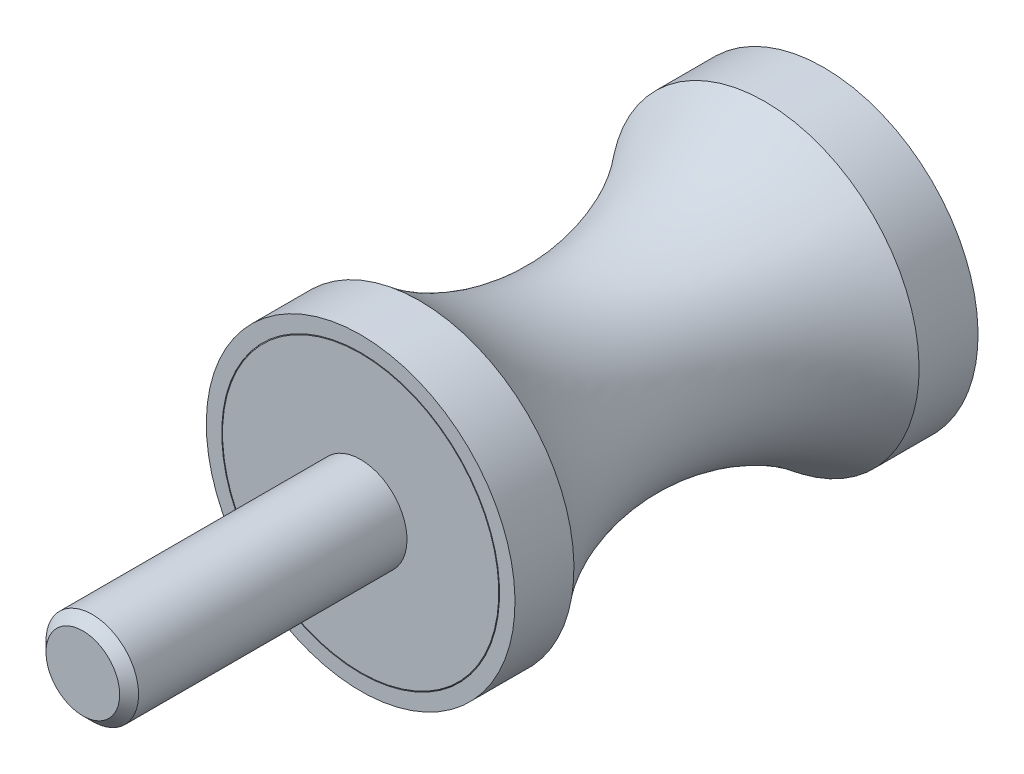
ISO-10303-21;
HEADER;
FILE_DESCRIPTION(('STEP AP214'),'2;1');
FILE_NAME('part.step','',(''),(''),'','','');
FILE_SCHEMA(('AUTOMOTIVE_DESIGN { 1 0 10303 214 1 1 1 1 }'));
ENDSEC;
DATA;
#1=APPLICATION_CONTEXT('core data for automotive mechanical design processes');
#2=APPLICATION_PROTOCOL_DEFINITION('international standard','automotive_design',2000,#1);
#3=PRODUCT_CONTEXT('',#1,'mechanical');
#4=PRODUCT('Part','Part','',(#3));
#5=PRODUCT_RELATED_PRODUCT_CATEGORY('part','',(#4));
#6=PRODUCT_DEFINITION_FORMATION('','',#4);
#7=PRODUCT_DEFINITION_CONTEXT('part definition',#1,'design');
#8=PRODUCT_DEFINITION('design','',#6,#7);
#9=PRODUCT_DEFINITION_SHAPE('','',#8);
#10=(LENGTH_UNIT() NAMED_UNIT(*) SI_UNIT(.MILLI.,.METRE.));
#11=(NAMED_UNIT(*) PLANE_ANGLE_UNIT() SI_UNIT($,.RADIAN.));
#12=(NAMED_UNIT(*) SI_UNIT($,.STERADIAN.) SOLID_ANGLE_UNIT());
#13=UNCERTAINTY_MEASURE_WITH_UNIT(LENGTH_MEASURE(1.E-05),#10,'distance_accuracy_value','');
#14=(GEOMETRIC_REPRESENTATION_CONTEXT(3) GLOBAL_UNCERTAINTY_ASSIGNED_CONTEXT((#13)) GLOBAL_UNIT_ASSIGNED_CONTEXT((#10,
#11,#12)) REPRESENTATION_CONTEXT('',''));
#15=CARTESIAN_POINT('',(0.,0.,0.));
#16=DIRECTION('',(0.,0.,1.));
#17=DIRECTION('',(1.,0.,0.));
#18=AXIS2_PLACEMENT_3D('',#15,#16,#17);
#19=CARTESIAN_POINT('',(0.,0.,0.5));
#20=DIRECTION('',(0.,0.,-1.));
#21=DIRECTION('',(0.,1.,0.));
#22=AXIS2_PLACEMENT_3D('',#19,#20,#21);
#23=CYLINDRICAL_SURFACE('',#22,9.);
#24=CARTESIAN_POINT('',(0.,0.,0.05));
#25=DIRECTION('',(0.,0.,-1.));
#26=DIRECTION('',(0.,1.,0.));
#27=AXIS2_PLACEMENT_3D('',#24,#25,#26);
#28=CIRCLE('',#27,9.);
#29=CARTESIAN_POINT('',(0.,9.,0.05));
#30=VERTEX_POINT('',#29);
#31=EDGE_CURVE('E53',#30,#30,#28,.T.);
#32=ORIENTED_EDGE('',*,*,#31,.F.);
#33=EDGE_LOOP('',(#32));
#34=FACE_BOUND('',#33,.T.);
#35=CARTESIAN_POINT('',(0.,0.,0.));
#36=DIRECTION('',(0.,0.,-1.));
#37=DIRECTION('',(0.,1.,0.));
#38=AXIS2_PLACEMENT_3D('',#35,#36,#37);
#39=CIRCLE('',#38,9.);
#40=CARTESIAN_POINT('',(0.,9.,0.));
#41=VERTEX_POINT('',#40);
#42=EDGE_CURVE('E44',#41,#41,#39,.T.);
#43=ORIENTED_EDGE('',*,*,#42,.T.);
#44=EDGE_LOOP('',(#43));
#45=FACE_BOUND('',#44,.T.);
#46=ADVANCED_FACE('F12',(#34,#45),#23,.F.);
#47=CARTESIAN_POINT('',(0.,0.,0.5));
#48=DIRECTION('',(0.,0.,-1.));
#49=DIRECTION('',(0.,1.,0.));
#50=AXIS2_PLACEMENT_3D('',#47,#48,#49);
#51=CYLINDRICAL_SURFACE('',#50,9.);
#52=CARTESIAN_POINT('',(0.,0.,30.));
#53=DIRECTION('',(0.,0.,-1.));
#54=DIRECTION('',(0.,1.,0.));
#55=AXIS2_PLACEMENT_3D('',#52,#53,#54);
#56=CIRCLE('',#55,9.);
#57=CARTESIAN_POINT('',(0.,9.,30.));
#58=VERTEX_POINT('',#57);
#59=EDGE_CURVE('E27',#58,#58,#56,.T.);
#60=ORIENTED_EDGE('',*,*,#59,.F.);
#61=EDGE_LOOP('',(#60));
#62=FACE_BOUND('',#61,.T.);
#63=CARTESIAN_POINT('',(0.,0.,29.95));
#64=DIRECTION('',(0.,0.,-1.));
#65=DIRECTION('',(0.,1.,0.));
#66=AXIS2_PLACEMENT_3D('',#63,#64,#65);
#67=CIRCLE('',#66,9.);
#68=CARTESIAN_POINT('',(0.,9.,29.95));
#69=VERTEX_POINT('',#68);
#70=EDGE_CURVE('E50',#69,#69,#67,.T.);
#71=ORIENTED_EDGE('',*,*,#70,.T.);
#72=EDGE_LOOP('',(#71));
#73=FACE_BOUND('',#72,.T.);
#74=ADVANCED_FACE('F89',(#62,#73),#51,.F.);
#75=CARTESIAN_POINT('',(9.,0.,30.));
#76=DIRECTION('',(0.,0.,-1.));
#77=DIRECTION('',(0.,1.,0.));
#78=AXIS2_PLACEMENT_3D('',#75,#76,#77);
#79=PLANE('',#78);
#80=CARTESIAN_POINT('',(0.,0.,30.));
#81=DIRECTION('',(0.,0.,-1.));
#82=DIRECTION('',(0.,1.,0.));
#83=AXIS2_PLACEMENT_3D('',#80,#81,#82);
#84=CIRCLE('',#83,10.);
#85=CARTESIAN_POINT('',(0.,10.,30.));
#86=VERTEX_POINT('',#85);
#87=EDGE_CURVE('E32',#86,#86,#84,.T.);
#88=ORIENTED_EDGE('',*,*,#87,.F.);
#89=EDGE_LOOP('',(#88));
#90=FACE_BOUND('',#89,.T.);
#91=ORIENTED_EDGE('',*,*,#59,.T.);
#92=EDGE_LOOP('',(#91));
#93=FACE_BOUND('',#92,.T.);
#94=ADVANCED_FACE('F115',(#90,#93),#79,.F.);
#95=CARTESIAN_POINT('',(0.,0.,0.5));
#96=DIRECTION('',(0.,0.,-1.));
#97=DIRECTION('',(0.,1.,0.));
#98=AXIS2_PLACEMENT_3D('',#95,#96,#97);
#99=CYLINDRICAL_SURFACE('',#98,10.);
#100=CARTESIAN_POINT('',(0.,0.,26.1803398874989));
#101=DIRECTION('',(0.,0.,-1.));
#102=DIRECTION('',(0.,1.,0.));
#103=AXIS2_PLACEMENT_3D('',#100,#101,#102);
#104=CIRCLE('',#103,10.);
#105=CARTESIAN_POINT('',(0.,10.,26.1803398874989));
#106=VERTEX_POINT('',#105);
#107=EDGE_CURVE('E35',#106,#106,#104,.T.);
#108=ORIENTED_EDGE('',*,*,#107,.F.);
#109=EDGE_LOOP('',(#108));
#110=FACE_BOUND('',#109,.T.);
#111=ORIENTED_EDGE('',*,*,#87,.T.);
#112=EDGE_LOOP('',(#111));
#113=FACE_BOUND('',#112,.T.);
#114=ADVANCED_FACE('F109',(#110,#113),#99,.T.);
#115=CARTESIAN_POINT('',(0.,0.,15.));
#116=DIRECTION('',(0.,0.,-1.));
#117=DIRECTION('',(0.,1.,0.));
#118=AXIS2_PLACEMENT_3D('',#115,#116,#117);
#119=TOROIDAL_SURFACE('',#118,23.625,17.625);
#120=CARTESIAN_POINT('',(0.,0.,3.81966011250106));
#121=DIRECTION('',(0.,0.,-1.));
#122=DIRECTION('',(0.,1.,0.));
#123=AXIS2_PLACEMENT_3D('',#120,#121,#122);
#124=CIRCLE('',#123,10.);
#125=CARTESIAN_POINT('',(0.,10.,3.81966011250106));
#126=VERTEX_POINT('',#125);
#127=EDGE_CURVE('E38',#126,#126,#124,.T.);
#128=ORIENTED_EDGE('',*,*,#127,.F.);
#129=EDGE_LOOP('',(#128));
#130=FACE_BOUND('',#129,.T.);
#131=ORIENTED_EDGE('',*,*,#107,.T.);
#132=EDGE_LOOP('',(#131));
#133=FACE_BOUND('',#132,.T.);
#134=ADVANCED_FACE('F103',(#130,#133),#119,.F.);
#135=CARTESIAN_POINT('',(0.,0.,0.5));
#136=DIRECTION('',(0.,0.,-1.));
#137=DIRECTION('',(0.,1.,0.));
#138=AXIS2_PLACEMENT_3D('',#135,#136,#137);
#139=CYLINDRICAL_SURFACE('',#138,10.);
#140=CARTESIAN_POINT('',(0.,0.,0.));
#141=DIRECTION('',(0.,0.,-1.));
#142=DIRECTION('',(0.,1.,0.));
#143=AXIS2_PLACEMENT_3D('',#140,#141,#142);
#144=CIRCLE('',#143,10.);
#145=CARTESIAN_POINT('',(0.,10.,0.));
#146=VERTEX_POINT('',#145);
#147=EDGE_CURVE('E41',#146,#146,#144,.T.);
#148=ORIENTED_EDGE('',*,*,#147,.F.);
#149=EDGE_LOOP('',(#148));
#150=FACE_BOUND('',#149,.T.);
#151=ORIENTED_EDGE('',*,*,#127,.T.);
#152=EDGE_LOOP('',(#151));
#153=FACE_BOUND('',#152,.T.);
#154=ADVANCED_FACE('F97',(#150,#153),#139,.T.);
#155=CARTESIAN_POINT('',(10.,0.,0.));
#156=DIRECTION('',(0.,0.,1.));
#157=DIRECTION('',(0.,-1.,0.));
#158=AXIS2_PLACEMENT_3D('',#155,#156,#157);
#159=PLANE('',#158);
#160=ORIENTED_EDGE('',*,*,#42,.F.);
#161=EDGE_LOOP('',(#160));
#162=FACE_BOUND('',#161,.T.);
#163=ORIENTED_EDGE('',*,*,#147,.T.);
#164=EDGE_LOOP('',(#163));
#165=FACE_BOUND('',#164,.T.);
#166=ADVANCED_FACE('F93',(#162,#165),#159,.F.);
#167=CARTESIAN_POINT('',(0.,0.,30.));
#168=DIRECTION('',(0.,0.,-1.));
#169=DIRECTION('',(0.,1.,0.));
#170=AXIS2_PLACEMENT_3D('',#167,#168,#169);
#171=PLANE('',#170);
#172=CARTESIAN_POINT('',(0.,0.,30.));
#173=DIRECTION('',(0.,0.,-1.));
#174=DIRECTION('',(0.,1.,0.));
#175=AXIS2_PLACEMENT_3D('',#172,#173,#174);
#176=CIRCLE('',#175,8.95);
#177=CARTESIAN_POINT('',(0.,8.95,30.));
#178=VERTEX_POINT('',#177);
#179=EDGE_CURVE('E47',#178,#178,#176,.T.);
#180=ORIENTED_EDGE('',*,*,#179,.F.);
#181=EDGE_LOOP('',(#180));
#182=FACE_BOUND('',#181,.T.);
#183=CARTESIAN_POINT('',(0.,0.,30.));
#184=DIRECTION('',(0.,0.,-1.));
#185=DIRECTION('',(0.,1.,0.));
#186=AXIS2_PLACEMENT_3D('',#183,#184,#185);
#187=CIRCLE('',#186,3.);
#188=CARTESIAN_POINT('',(0.,3.,30.));
#189=VERTEX_POINT('',#188);
#190=EDGE_CURVE('E8',#189,#189,#187,.T.);
#191=ORIENTED_EDGE('',*,*,#190,.T.);
#192=EDGE_LOOP('',(#191));
#193=FACE_BOUND('',#192,.T.);
#194=ADVANCED_FACE('F96',(#182,#193),#171,.F.);
#195=CARTESIAN_POINT('',(0.,0.,30.));
#196=DIRECTION('',(0.,0.,-1.));
#197=DIRECTION('',(0.,1.,0.));
#198=AXIS2_PLACEMENT_3D('',#195,#196,#197);
#199=CONICAL_SURFACE('',#198,8.95,0.7853981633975);
#200=ORIENTED_EDGE('',*,*,#70,.F.);
#201=EDGE_LOOP('',(#200));
#202=FACE_BOUND('',#201,.T.);
#203=ORIENTED_EDGE('',*,*,#179,.T.);
#204=EDGE_LOOP('',(#203));
#205=FACE_BOUND('',#204,.T.);
#206=ADVANCED_FACE('F129',(#202,#205),#199,.T.);
#207=CARTESIAN_POINT('',(0.,0.,48.));
#208=DIRECTION('',(0.,0.,-1.));
#209=DIRECTION('',(0.,1.,0.));
#210=AXIS2_PLACEMENT_3D('',#207,#208,#209);
#211=PLANE('',#210);
#212=CARTESIAN_POINT('',(0.,0.,48.));
#213=DIRECTION('',(0.,0.,-1.));
#214=DIRECTION('',(0.,1.,0.));
#215=AXIS2_PLACEMENT_3D('',#212,#213,#214);
#216=CIRCLE('',#215,2.3865);
#217=CARTESIAN_POINT('',(0.,2.3865,48.));
#218=VERTEX_POINT('',#217);
#219=EDGE_CURVE('E19',#218,#218,#216,.T.);
#220=ORIENTED_EDGE('',*,*,#219,.F.);
#221=EDGE_LOOP('',(#220));
#222=FACE_BOUND('',#221,.T.);
#223=ADVANCED_FACE('F14',(#222),#211,.F.);
#224=CARTESIAN_POINT('',(0.,0.,48.));
#225=DIRECTION('',(0.,0.,-1.));
#226=DIRECTION('',(0.,1.,0.));
#227=AXIS2_PLACEMENT_3D('',#224,#225,#226);
#228=CONICAL_SURFACE('',#227,2.3865,0.785398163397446);
#229=CARTESIAN_POINT('',(0.,0.,47.3865));
#230=DIRECTION('',(0.,0.,-1.));
#231=DIRECTION('',(0.,1.,0.));
#232=AXIS2_PLACEMENT_3D('',#229,#230,#231);
#233=CIRCLE('',#232,3.);
#234=CARTESIAN_POINT('',(0.,3.,47.3865));
#235=VERTEX_POINT('',#234);
#236=EDGE_CURVE('E23',#235,#235,#233,.T.);
#237=ORIENTED_EDGE('',*,*,#236,.F.);
#238=EDGE_LOOP('',(#237));
#239=FACE_BOUND('',#238,.T.);
#240=ORIENTED_EDGE('',*,*,#219,.T.);
#241=EDGE_LOOP('',(#240));
#242=FACE_BOUND('',#241,.T.);
#243=ADVANCED_FACE('F142',(#239,#242),#228,.T.);
#244=CARTESIAN_POINT('',(0.,0.,0.5));
#245=DIRECTION('',(0.,0.,-1.));
#246=DIRECTION('',(0.,1.,0.));
#247=AXIS2_PLACEMENT_3D('',#244,#245,#246);
#248=CYLINDRICAL_SURFACE('',#247,3.);
#249=ORIENTED_EDGE('',*,*,#190,.F.);
#250=EDGE_LOOP('',(#249));
#251=FACE_BOUND('',#250,.T.);
#252=ORIENTED_EDGE('',*,*,#236,.T.);
#253=EDGE_LOOP('',(#252));
#254=FACE_BOUND('',#253,.T.);
#255=ADVANCED_FACE('F83',(#251,#254),#248,.T.);
#256=CARTESIAN_POINT('',(0.,0.,0.05));
#257=DIRECTION('',(0.,0.,1.));
#258=DIRECTION('',(0.,-1.,0.));
#259=AXIS2_PLACEMENT_3D('',#256,#257,#258);
#260=CONICAL_SURFACE('',#259,9.,0.785398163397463);
#261=CARTESIAN_POINT('',(0.,0.,0.));
#262=DIRECTION('',(0.,0.,-1.));
#263=DIRECTION('',(0.,1.,0.));
#264=AXIS2_PLACEMENT_3D('',#261,#262,#263);
#265=CIRCLE('',#264,8.95);
#266=CARTESIAN_POINT('',(0.,8.95,0.));
#267=VERTEX_POINT('',#266);
#268=EDGE_CURVE('E56',#267,#267,#265,.T.);
#269=ORIENTED_EDGE('',*,*,#268,.F.);
#270=EDGE_LOOP('',(#269));
#271=FACE_BOUND('',#270,.T.);
#272=ORIENTED_EDGE('',*,*,#31,.T.);
#273=EDGE_LOOP('',(#272));
#274=FACE_BOUND('',#273,.T.);
#275=ADVANCED_FACE('F77',(#271,#274),#260,.T.);
#276=CARTESIAN_POINT('',(8.95,0.,0.));
#277=DIRECTION('',(0.,0.,1.));
#278=DIRECTION('',(0.,-1.,0.));
#279=AXIS2_PLACEMENT_3D('',#276,#277,#278);
#280=PLANE('',#279);
#281=CARTESIAN_POINT('',(0.,0.,0.));
#282=DIRECTION('',(0.,0.,-1.));
#283=DIRECTION('',(0.,1.,0.));
#284=AXIS2_PLACEMENT_3D('',#281,#282,#283);
#285=CIRCLE('',#284,3.);
#286=CARTESIAN_POINT('',(0.,3.,0.));
#287=VERTEX_POINT('',#286);
#288=EDGE_CURVE('E60',#287,#287,#285,.T.);
#289=ORIENTED_EDGE('',*,*,#288,.F.);
#290=EDGE_LOOP('',(#289));
#291=FACE_BOUND('',#290,.T.);
#292=ORIENTED_EDGE('',*,*,#268,.T.);
#293=EDGE_LOOP('',(#292));
#294=FACE_BOUND('',#293,.T.);
#295=ADVANCED_FACE('F71',(#291,#294),#280,.F.);
#296=CARTESIAN_POINT('',(0.,0.,6.));
#297=DIRECTION('',(0.,0.,-1.));
#298=DIRECTION('',(0.,1.,0.));
#299=AXIS2_PLACEMENT_3D('',#296,#297,#298);
#300=CYLINDRICAL_SURFACE('',#299,3.);
#301=CARTESIAN_POINT('',(0.,0.,6.));
#302=DIRECTION('',(0.,0.,-1.));
#303=DIRECTION('',(0.,1.,0.));
#304=AXIS2_PLACEMENT_3D('',#301,#302,#303);
#305=CIRCLE('',#304,3.);
#306=CARTESIAN_POINT('',(0.,3.,6.));
#307=VERTEX_POINT('',#306);
#308=EDGE_CURVE('E59',#307,#307,#305,.T.);
#309=ORIENTED_EDGE('',*,*,#308,.F.);
#310=EDGE_LOOP('',(#309));
#311=FACE_BOUND('',#310,.T.);
#312=ORIENTED_EDGE('',*,*,#288,.T.);
#313=EDGE_LOOP('',(#312));
#314=FACE_BOUND('',#313,.T.);
#315=ADVANCED_FACE('F68',(#311,#314),#300,.F.);
#316=CARTESIAN_POINT('',(0.,0.,6.));
#317=DIRECTION('',(0.,0.,-1.));
#318=DIRECTION('',(0.,1.,0.));
#319=AXIS2_PLACEMENT_3D('',#316,#317,#318);
#320=PLANE('',#319);
#321=ORIENTED_EDGE('',*,*,#308,.T.);
#322=EDGE_LOOP('',(#321));
#323=FACE_BOUND('',#322,.T.);
#324=ADVANCED_FACE('F66',(#323),#320,.T.);
#325=CLOSED_SHELL('',(#46,#74,#94,#114,#134,#154,#166,#194,#206,#223,#243,#255,#275,#295,#315,#324));
#326=MANIFOLD_SOLID_BREP('B1',#325);
#327=ADVANCED_BREP_SHAPE_REPRESENTATION('',(#18,#326),#14);
#328=SHAPE_DEFINITION_REPRESENTATION(#9,#327);
ENDSEC;
END-ISO-10303-21;
